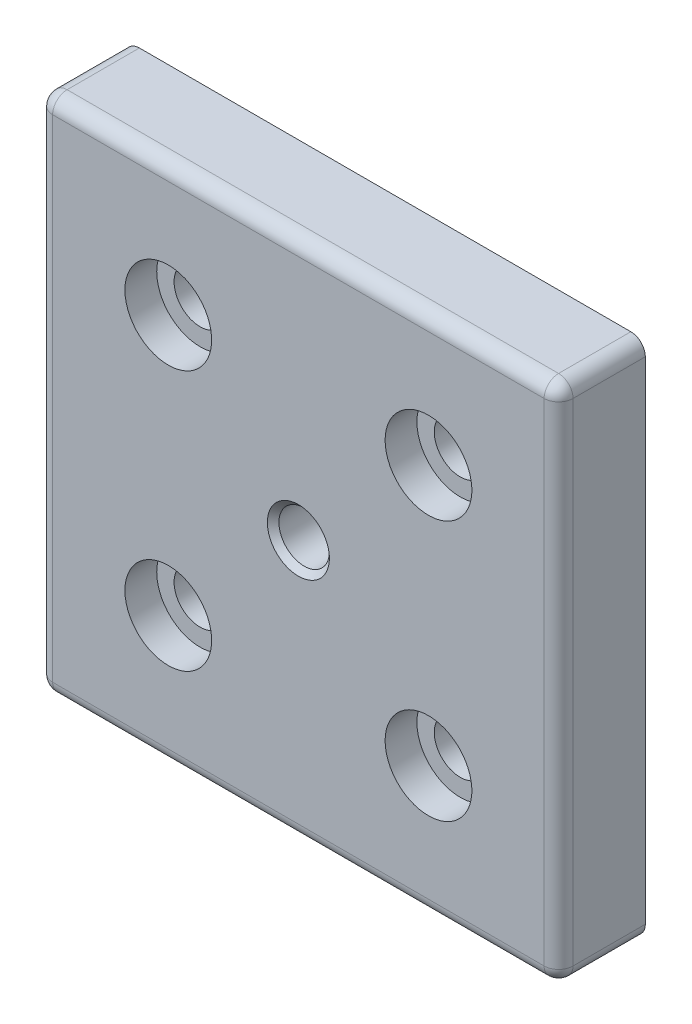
ISO-10303-21;
HEADER;
FILE_DESCRIPTION(('STEP AP214'),'2;1');
FILE_NAME('part.step','',(''),(''),'','','');
FILE_SCHEMA(('AUTOMOTIVE_DESIGN { 1 0 10303 214 1 1 1 1 }'));
ENDSEC;
DATA;
#1=APPLICATION_CONTEXT('core data for automotive mechanical design processes');
#2=APPLICATION_PROTOCOL_DEFINITION('international standard','automotive_design',2000,#1);
#3=PRODUCT_CONTEXT('',#1,'mechanical');
#4=PRODUCT('Part','Part','',(#3));
#5=PRODUCT_RELATED_PRODUCT_CATEGORY('part','',(#4));
#6=PRODUCT_DEFINITION_FORMATION('','',#4);
#7=PRODUCT_DEFINITION_CONTEXT('part definition',#1,'design');
#8=PRODUCT_DEFINITION('design','',#6,#7);
#9=PRODUCT_DEFINITION_SHAPE('','',#8);
#10=(LENGTH_UNIT() NAMED_UNIT(*) SI_UNIT(.MILLI.,.METRE.));
#11=(NAMED_UNIT(*) PLANE_ANGLE_UNIT() SI_UNIT($,.RADIAN.));
#12=(NAMED_UNIT(*) SI_UNIT($,.STERADIAN.) SOLID_ANGLE_UNIT());
#13=UNCERTAINTY_MEASURE_WITH_UNIT(LENGTH_MEASURE(1.E-05),#10,'distance_accuracy_value','');
#14=(GEOMETRIC_REPRESENTATION_CONTEXT(3) GLOBAL_UNCERTAINTY_ASSIGNED_CONTEXT((#13)) GLOBAL_UNIT_ASSIGNED_CONTEXT((#10,
#11,#12)) REPRESENTATION_CONTEXT('',''));
#15=CARTESIAN_POINT('',(0.,0.,0.));
#16=DIRECTION('',(0.,0.,1.));
#17=DIRECTION('',(1.,0.,0.));
#18=AXIS2_PLACEMENT_3D('',#15,#16,#17);
#19=CARTESIAN_POINT('',(0.,0.,15.));
#20=DIRECTION('',(0.,0.,1.));
#21=DIRECTION('',(1.,0.,0.));
#22=AXIS2_PLACEMENT_3D('',#19,#20,#21);
#23=PLANE('',#22);
#24=CARTESIAN_POINT('',(0.,0.,15.0000000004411));
#25=DIRECTION('',(0.,0.,1.));
#26=DIRECTION('',(1.,0.,0.));
#27=AXIS2_PLACEMENT_3D('',#24,#25,#26);
#28=CIRCLE('',#27,5.36562499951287);
#29=CARTESIAN_POINT('',(5.36562499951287,0.,15.0000000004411));
#30=VERTEX_POINT('',#29);
#31=EDGE_CURVE('E119',#30,#30,#28,.F.);
#32=ORIENTED_EDGE('',*,*,#31,.T.);
#33=EDGE_LOOP('',(#32));
#34=FACE_BOUND('',#33,.T.);
#35=CARTESIAN_POINT('',(22.5,-22.5,15.));
#36=DIRECTION('',(0.,0.,-1.));
#37=DIRECTION('',(-1.,0.,0.));
#38=AXIS2_PLACEMENT_3D('',#35,#36,#37);
#39=CIRCLE('',#38,7.5);
#40=CARTESIAN_POINT('',(15.,-22.5,15.));
#41=VERTEX_POINT('',#40);
#42=EDGE_CURVE('E123',#41,#41,#39,.T.);
#43=ORIENTED_EDGE('',*,*,#42,.T.);
#44=EDGE_LOOP('',(#43));
#45=FACE_BOUND('',#44,.T.);
#46=CARTESIAN_POINT('',(-22.5,-22.5,15.));
#47=DIRECTION('',(0.,0.,-1.));
#48=DIRECTION('',(-1.,0.,0.));
#49=AXIS2_PLACEMENT_3D('',#46,#47,#48);
#50=CIRCLE('',#49,7.5);
#51=CARTESIAN_POINT('',(-30.,-22.5,15.));
#52=VERTEX_POINT('',#51);
#53=EDGE_CURVE('E127',#52,#52,#50,.T.);
#54=ORIENTED_EDGE('',*,*,#53,.T.);
#55=EDGE_LOOP('',(#54));
#56=FACE_BOUND('',#55,.T.);
#57=CARTESIAN_POINT('',(-22.5,22.5,15.));
#58=DIRECTION('',(0.,0.,-1.));
#59=DIRECTION('',(-1.,0.,0.));
#60=AXIS2_PLACEMENT_3D('',#57,#58,#59);
#61=CIRCLE('',#60,7.5);
#62=CARTESIAN_POINT('',(-30.,22.5,15.));
#63=VERTEX_POINT('',#62);
#64=EDGE_CURVE('E19',#63,#63,#61,.T.);
#65=ORIENTED_EDGE('',*,*,#64,.T.);
#66=EDGE_LOOP('',(#65));
#67=FACE_BOUND('',#66,.T.);
#68=CARTESIAN_POINT('',(22.5,22.5,15.));
#69=DIRECTION('',(0.,0.,-1.));
#70=DIRECTION('',(-1.,0.,0.));
#71=AXIS2_PLACEMENT_3D('',#68,#69,#70);
#72=CIRCLE('',#71,7.5);
#73=CARTESIAN_POINT('',(15.,22.5,15.));
#74=VERTEX_POINT('',#73);
#75=EDGE_CURVE('E129',#74,#74,#72,.T.);
#76=ORIENTED_EDGE('',*,*,#75,.T.);
#77=EDGE_LOOP('',(#76));
#78=FACE_BOUND('',#77,.T.);
#79=DIRECTION('',(-1.,0.,0.));
#80=VECTOR('',#79,1.);
#81=CARTESIAN_POINT('',(22.5,-42.5,15.));
#82=LINE('',#81,#80);
#83=CARTESIAN_POINT('',(42.5,-42.5,15.));
#84=VERTEX_POINT('',#83);
#85=CARTESIAN_POINT('',(-42.5,-42.5,15.));
#86=VERTEX_POINT('',#85);
#87=EDGE_CURVE('E362',#84,#86,#82,.T.);
#88=ORIENTED_EDGE('',*,*,#87,.F.);
#89=DIRECTION('',(0.,-1.,0.));
#90=VECTOR('',#89,1.);
#91=CARTESIAN_POINT('',(42.5,22.5,15.));
#92=LINE('',#91,#90);
#93=CARTESIAN_POINT('',(42.5,42.5,15.));
#94=VERTEX_POINT('',#93);
#95=EDGE_CURVE('E229',#94,#84,#92,.T.);
#96=ORIENTED_EDGE('',*,*,#95,.F.);
#97=DIRECTION('',(1.,0.,0.));
#98=VECTOR('',#97,1.);
#99=CARTESIAN_POINT('',(-22.5,42.5,15.));
#100=LINE('',#99,#98);
#101=CARTESIAN_POINT('',(-42.5,42.5,15.));
#102=VERTEX_POINT('',#101);
#103=EDGE_CURVE('E126',#102,#94,#100,.T.);
#104=ORIENTED_EDGE('',*,*,#103,.F.);
#105=DIRECTION('',(0.,1.,0.));
#106=VECTOR('',#105,1.);
#107=CARTESIAN_POINT('',(-42.5,-22.5,15.));
#108=LINE('',#107,#106);
#109=EDGE_CURVE('E272',#86,#102,#108,.T.);
#110=ORIENTED_EDGE('',*,*,#109,.F.);
#111=EDGE_LOOP('',(#88,#96,#104,#110));
#112=FACE_BOUND('',#111,.T.);
#113=ADVANCED_FACE('F15',(#34,#45,#56,#67,#78,#112),#23,.T.);
#114=CARTESIAN_POINT('',(-22.5,22.5,15.));
#115=DIRECTION('',(0.,0.,-1.));
#116=DIRECTION('',(-1.,0.,0.));
#117=AXIS2_PLACEMENT_3D('',#114,#115,#116);
#118=CYLINDRICAL_SURFACE('',#117,7.5);
#119=CARTESIAN_POINT('',(-22.5,22.5,9.5));
#120=DIRECTION('',(0.,0.,-1.));
#121=DIRECTION('',(-1.,0.,0.));
#122=AXIS2_PLACEMENT_3D('',#119,#120,#121);
#123=CIRCLE('',#122,7.5);
#124=CARTESIAN_POINT('',(-30.,22.5,9.5));
#125=VERTEX_POINT('',#124);
#126=EDGE_CURVE('E116',#125,#125,#123,.T.);
#127=ORIENTED_EDGE('',*,*,#126,.T.);
#128=EDGE_LOOP('',(#127));
#129=FACE_BOUND('',#128,.T.);
#130=ORIENTED_EDGE('',*,*,#64,.F.);
#131=EDGE_LOOP('',(#130));
#132=FACE_BOUND('',#131,.T.);
#133=ADVANCED_FACE('F137',(#129,#132),#118,.F.);
#134=CARTESIAN_POINT('',(22.5,22.5,15.));
#135=DIRECTION('',(0.,0.,-1.));
#136=DIRECTION('',(-1.,0.,0.));
#137=AXIS2_PLACEMENT_3D('',#134,#135,#136);
#138=CYLINDRICAL_SURFACE('',#137,7.5);
#139=CARTESIAN_POINT('',(22.5,22.5,9.5));
#140=DIRECTION('',(0.,0.,-1.));
#141=DIRECTION('',(-1.,0.,0.));
#142=AXIS2_PLACEMENT_3D('',#139,#140,#141);
#143=CIRCLE('',#142,7.5);
#144=CARTESIAN_POINT('',(15.,22.5,9.5));
#145=VERTEX_POINT('',#144);
#146=EDGE_CURVE('E113',#145,#145,#143,.T.);
#147=ORIENTED_EDGE('',*,*,#146,.T.);
#148=EDGE_LOOP('',(#147));
#149=FACE_BOUND('',#148,.T.);
#150=ORIENTED_EDGE('',*,*,#75,.F.);
#151=EDGE_LOOP('',(#150));
#152=FACE_BOUND('',#151,.T.);
#153=ADVANCED_FACE('F139',(#149,#152),#138,.F.);
#154=CARTESIAN_POINT('',(-22.5,-22.5,15.));
#155=DIRECTION('',(0.,0.,-1.));
#156=DIRECTION('',(-1.,0.,0.));
#157=AXIS2_PLACEMENT_3D('',#154,#155,#156);
#158=CYLINDRICAL_SURFACE('',#157,7.5);
#159=CARTESIAN_POINT('',(-22.5,-22.5,9.5));
#160=DIRECTION('',(0.,0.,-1.));
#161=DIRECTION('',(-1.,0.,0.));
#162=AXIS2_PLACEMENT_3D('',#159,#160,#161);
#163=CIRCLE('',#162,7.5);
#164=CARTESIAN_POINT('',(-30.,-22.5,9.5));
#165=VERTEX_POINT('',#164);
#166=EDGE_CURVE('E110',#165,#165,#163,.T.);
#167=ORIENTED_EDGE('',*,*,#166,.T.);
#168=EDGE_LOOP('',(#167));
#169=FACE_BOUND('',#168,.T.);
#170=ORIENTED_EDGE('',*,*,#53,.F.);
#171=EDGE_LOOP('',(#170));
#172=FACE_BOUND('',#171,.T.);
#173=ADVANCED_FACE('F147',(#169,#172),#158,.F.);
#174=CARTESIAN_POINT('',(22.5,-22.5,15.));
#175=DIRECTION('',(0.,0.,-1.));
#176=DIRECTION('',(-1.,0.,0.));
#177=AXIS2_PLACEMENT_3D('',#174,#175,#176);
#178=CYLINDRICAL_SURFACE('',#177,7.5);
#179=CARTESIAN_POINT('',(22.5,-22.5,9.5));
#180=DIRECTION('',(0.,0.,-1.));
#181=DIRECTION('',(-1.,0.,0.));
#182=AXIS2_PLACEMENT_3D('',#179,#180,#181);
#183=CIRCLE('',#182,7.5);
#184=CARTESIAN_POINT('',(15.,-22.5,9.5));
#185=VERTEX_POINT('',#184);
#186=EDGE_CURVE('E106',#185,#185,#183,.T.);
#187=ORIENTED_EDGE('',*,*,#186,.T.);
#188=EDGE_LOOP('',(#187));
#189=FACE_BOUND('',#188,.T.);
#190=ORIENTED_EDGE('',*,*,#42,.F.);
#191=EDGE_LOOP('',(#190));
#192=FACE_BOUND('',#191,.T.);
#193=ADVANCED_FACE('F287',(#189,#192),#178,.F.);
#194=CARTESIAN_POINT('',(-22.5,42.5,12.5));
#195=DIRECTION('',(1.,0.,0.));
#196=DIRECTION('',(0.,1.,0.));
#197=AXIS2_PLACEMENT_3D('',#194,#195,#196);
#198=CYLINDRICAL_SURFACE('',#197,2.5);
#199=CARTESIAN_POINT('',(-42.5,42.5,12.5));
#200=DIRECTION('',(1.,0.,0.));
#201=DIRECTION('',(0.,1.,0.));
#202=AXIS2_PLACEMENT_3D('',#199,#200,#201);
#203=CIRCLE('',#202,2.5);
#204=CARTESIAN_POINT('',(-42.5,45.,12.5));
#205=VERTEX_POINT('',#204);
#206=EDGE_CURVE('E276',#102,#205,#203,.F.);
#207=ORIENTED_EDGE('',*,*,#206,.F.);
#208=ORIENTED_EDGE('',*,*,#103,.T.);
#209=CARTESIAN_POINT('',(42.5,42.5,12.5));
#210=DIRECTION('',(1.,0.,0.));
#211=DIRECTION('',(0.,1.,0.));
#212=AXIS2_PLACEMENT_3D('',#209,#210,#211);
#213=CIRCLE('',#212,2.5);
#214=CARTESIAN_POINT('',(42.5,45.,12.5));
#215=VERTEX_POINT('',#214);
#216=EDGE_CURVE('E226',#215,#94,#213,.T.);
#217=ORIENTED_EDGE('',*,*,#216,.F.);
#218=DIRECTION('',(1.,0.,0.));
#219=VECTOR('',#218,1.);
#220=CARTESIAN_POINT('',(-45.,45.,12.5));
#221=LINE('',#220,#219);
#222=EDGE_CURVE('E109',#205,#215,#221,.T.);
#223=ORIENTED_EDGE('',*,*,#222,.F.);
#224=EDGE_LOOP('',(#207,#208,#217,#223));
#225=FACE_BOUND('',#224,.T.);
#226=ADVANCED_FACE('F284',(#225),#198,.T.);
#227=CARTESIAN_POINT('',(-42.5,42.5,12.5));
#228=DIRECTION('',(1.,0.,0.));
#229=DIRECTION('',(0.,1.,0.));
#230=AXIS2_PLACEMENT_3D('',#227,#228,#229);
#231=SPHERICAL_SURFACE('',#230,2.5);
#232=ORIENTED_EDGE('',*,*,#206,.T.);
#233=CARTESIAN_POINT('',(-42.5,42.5,12.5));
#234=DIRECTION('',(0.,0.,1.));
#235=DIRECTION('',(1.,0.,0.));
#236=AXIS2_PLACEMENT_3D('',#233,#234,#235);
#237=CIRCLE('',#236,2.5);
#238=CARTESIAN_POINT('',(-45.,42.5,12.5));
#239=VERTEX_POINT('',#238);
#240=EDGE_CURVE('E232',#239,#205,#237,.F.);
#241=ORIENTED_EDGE('',*,*,#240,.F.);
#242=CARTESIAN_POINT('',(-42.5,42.5,12.5));
#243=DIRECTION('',(0.,1.,0.));
#244=DIRECTION('',(-1.,0.,0.));
#245=AXIS2_PLACEMENT_3D('',#242,#243,#244);
#246=CIRCLE('',#245,2.5);
#247=EDGE_CURVE('E273',#102,#239,#246,.F.);
#248=ORIENTED_EDGE('',*,*,#247,.F.);
#249=EDGE_LOOP('',(#232,#241,#248));
#250=FACE_BOUND('',#249,.T.);
#251=ADVANCED_FACE('F281',(#250),#231,.T.);
#252=CARTESIAN_POINT('',(-42.5,-22.5,12.5));
#253=DIRECTION('',(0.,1.,0.));
#254=DIRECTION('',(-1.,0.,0.));
#255=AXIS2_PLACEMENT_3D('',#252,#253,#254);
#256=CYLINDRICAL_SURFACE('',#255,2.5);
#257=CARTESIAN_POINT('',(-42.5,-42.5,12.5));
#258=DIRECTION('',(0.,-1.,0.));
#259=DIRECTION('',(1.,0.,0.));
#260=AXIS2_PLACEMENT_3D('',#257,#258,#259);
#261=CIRCLE('',#260,2.5);
#262=CARTESIAN_POINT('',(-45.,-42.5,12.5));
#263=VERTEX_POINT('',#262);
#264=EDGE_CURVE('E268',#86,#263,#261,.T.);
#265=ORIENTED_EDGE('',*,*,#264,.F.);
#266=ORIENTED_EDGE('',*,*,#109,.T.);
#267=ORIENTED_EDGE('',*,*,#247,.T.);
#268=DIRECTION('',(0.,1.,0.));
#269=VECTOR('',#268,1.);
#270=CARTESIAN_POINT('',(-45.,-45.,12.5));
#271=LINE('',#270,#269);
#272=EDGE_CURVE('E74',#263,#239,#271,.T.);
#273=ORIENTED_EDGE('',*,*,#272,.F.);
#274=EDGE_LOOP('',(#265,#266,#267,#273));
#275=FACE_BOUND('',#274,.T.);
#276=ADVANCED_FACE('F261',(#275),#256,.T.);
#277=CARTESIAN_POINT('',(-42.5,-42.5,12.5));
#278=DIRECTION('',(1.,0.,0.));
#279=DIRECTION('',(0.,1.,0.));
#280=AXIS2_PLACEMENT_3D('',#277,#278,#279);
#281=SPHERICAL_SURFACE('',#280,2.5);
#282=ORIENTED_EDGE('',*,*,#264,.T.);
#283=CARTESIAN_POINT('',(-42.5,-42.5,12.5));
#284=DIRECTION('',(0.,0.,1.));
#285=DIRECTION('',(1.,0.,0.));
#286=AXIS2_PLACEMENT_3D('',#283,#284,#285);
#287=CIRCLE('',#286,2.5);
#288=CARTESIAN_POINT('',(-42.5,-45.,12.5));
#289=VERTEX_POINT('',#288);
#290=EDGE_CURVE('E357',#289,#263,#287,.F.);
#291=ORIENTED_EDGE('',*,*,#290,.F.);
#292=CARTESIAN_POINT('',(-42.5,-42.5,12.5));
#293=DIRECTION('',(-1.,0.,0.));
#294=DIRECTION('',(0.,-1.,0.));
#295=AXIS2_PLACEMENT_3D('',#292,#293,#294);
#296=CIRCLE('',#295,2.5);
#297=EDGE_CURVE('E271',#86,#289,#296,.F.);
#298=ORIENTED_EDGE('',*,*,#297,.F.);
#299=EDGE_LOOP('',(#282,#291,#298));
#300=FACE_BOUND('',#299,.T.);
#301=ADVANCED_FACE('F256',(#300),#281,.T.);
#302=CARTESIAN_POINT('',(22.5,-42.5,12.5));
#303=DIRECTION('',(-1.,0.,0.));
#304=DIRECTION('',(0.,-1.,0.));
#305=AXIS2_PLACEMENT_3D('',#302,#303,#304);
#306=CYLINDRICAL_SURFACE('',#305,2.5);
#307=CARTESIAN_POINT('',(42.5,-42.5,12.5));
#308=DIRECTION('',(1.,0.,0.));
#309=DIRECTION('',(0.,1.,0.));
#310=AXIS2_PLACEMENT_3D('',#307,#308,#309);
#311=CIRCLE('',#310,2.5);
#312=CARTESIAN_POINT('',(42.5,-45.,12.5));
#313=VERTEX_POINT('',#312);
#314=EDGE_CURVE('E241',#84,#313,#311,.T.);
#315=ORIENTED_EDGE('',*,*,#314,.F.);
#316=ORIENTED_EDGE('',*,*,#87,.T.);
#317=ORIENTED_EDGE('',*,*,#297,.T.);
#318=DIRECTION('',(1.,0.,0.));
#319=VECTOR('',#318,1.);
#320=CARTESIAN_POINT('',(45.,-45.,12.5));
#321=LINE('',#320,#319);
#322=EDGE_CURVE('E242',#313,#289,#321,.F.);
#323=ORIENTED_EDGE('',*,*,#322,.F.);
#324=EDGE_LOOP('',(#315,#316,#317,#323));
#325=FACE_BOUND('',#324,.T.);
#326=ADVANCED_FACE('F252',(#325),#306,.T.);
#327=CARTESIAN_POINT('',(42.5,-42.5,12.5));
#328=DIRECTION('',(1.,0.,0.));
#329=DIRECTION('',(0.,1.,0.));
#330=AXIS2_PLACEMENT_3D('',#327,#328,#329);
#331=SPHERICAL_SURFACE('',#330,2.5);
#332=CARTESIAN_POINT('',(42.5,-42.5,12.5));
#333=DIRECTION('',(0.,-1.,0.));
#334=DIRECTION('',(0.,0.,-1.));
#335=AXIS2_PLACEMENT_3D('',#332,#333,#334);
#336=CIRCLE('',#335,2.5);
#337=CARTESIAN_POINT('',(45.,-42.5,12.5));
#338=VERTEX_POINT('',#337);
#339=EDGE_CURVE('E238',#84,#338,#336,.F.);
#340=ORIENTED_EDGE('',*,*,#339,.F.);
#341=ORIENTED_EDGE('',*,*,#314,.T.);
#342=CARTESIAN_POINT('',(42.5,-42.5,12.5));
#343=DIRECTION('',(0.,0.,1.));
#344=DIRECTION('',(1.,0.,0.));
#345=AXIS2_PLACEMENT_3D('',#342,#343,#344);
#346=CIRCLE('',#345,2.5);
#347=EDGE_CURVE('E233',#338,#313,#346,.F.);
#348=ORIENTED_EDGE('',*,*,#347,.F.);
#349=EDGE_LOOP('',(#340,#341,#348));
#350=FACE_BOUND('',#349,.T.);
#351=ADVANCED_FACE('F249',(#350),#331,.T.);
#352=CARTESIAN_POINT('',(42.5,22.5,12.5));
#353=DIRECTION('',(0.,-1.,0.));
#354=DIRECTION('',(0.,0.,-1.));
#355=AXIS2_PLACEMENT_3D('',#352,#353,#354);
#356=CYLINDRICAL_SURFACE('',#355,2.5);
#357=CARTESIAN_POINT('',(42.5,42.5,12.5));
#358=DIRECTION('',(0.,-1.,0.));
#359=DIRECTION('',(1.,0.,0.));
#360=AXIS2_PLACEMENT_3D('',#357,#358,#359);
#361=CIRCLE('',#360,2.5);
#362=CARTESIAN_POINT('',(45.,42.5,12.5));
#363=VERTEX_POINT('',#362);
#364=EDGE_CURVE('E122',#94,#363,#361,.F.);
#365=ORIENTED_EDGE('',*,*,#364,.F.);
#366=ORIENTED_EDGE('',*,*,#95,.T.);
#367=ORIENTED_EDGE('',*,*,#339,.T.);
#368=DIRECTION('',(0.,1.,0.));
#369=VECTOR('',#368,1.);
#370=CARTESIAN_POINT('',(45.,45.,12.5));
#371=LINE('',#370,#369);
#372=EDGE_CURVE('E341',#363,#338,#371,.F.);
#373=ORIENTED_EDGE('',*,*,#372,.F.);
#374=EDGE_LOOP('',(#365,#366,#367,#373));
#375=FACE_BOUND('',#374,.T.);
#376=ADVANCED_FACE('F216',(#375),#356,.T.);
#377=CARTESIAN_POINT('',(42.5,42.5,12.5));
#378=DIRECTION('',(1.,0.,0.));
#379=DIRECTION('',(0.,1.,0.));
#380=AXIS2_PLACEMENT_3D('',#377,#378,#379);
#381=SPHERICAL_SURFACE('',#380,2.5);
#382=ORIENTED_EDGE('',*,*,#216,.T.);
#383=ORIENTED_EDGE('',*,*,#364,.T.);
#384=CARTESIAN_POINT('',(42.5,42.5,12.5));
#385=DIRECTION('',(0.,0.,1.));
#386=DIRECTION('',(1.,0.,0.));
#387=AXIS2_PLACEMENT_3D('',#384,#385,#386);
#388=CIRCLE('',#387,2.5);
#389=EDGE_CURVE('E222',#215,#363,#388,.F.);
#390=ORIENTED_EDGE('',*,*,#389,.F.);
#391=EDGE_LOOP('',(#382,#383,#390));
#392=FACE_BOUND('',#391,.T.);
#393=ADVANCED_FACE('F211',(#392),#381,.T.);
#394=CARTESIAN_POINT('',(0.,0.,15.0000000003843));
#395=DIRECTION('',(0.,0.,1.));
#396=DIRECTION('',(1.,0.,0.));
#397=AXIS2_PLACEMENT_3D('',#394,#395,#396);
#398=CONICAL_SURFACE('',#397,5.36562499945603,0.785398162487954);
#399=ORIENTED_EDGE('',*,*,#31,.F.);
#400=EDGE_LOOP('',(#399));
#401=FACE_BOUND('',#400,.T.);
#402=CARTESIAN_POINT('',(0.,0.,14.));
#403=DIRECTION('',(0.,0.,1.));
#404=DIRECTION('',(1.,0.,0.));
#405=AXIS2_PLACEMENT_3D('',#402,#403,#404);
#406=CIRCLE('',#405,4.365625);
#407=CARTESIAN_POINT('',(4.365625,0.,14.));
#408=VERTEX_POINT('',#407);
#409=EDGE_CURVE('E105',#408,#408,#406,.F.);
#410=ORIENTED_EDGE('',*,*,#409,.T.);
#411=EDGE_LOOP('',(#410));
#412=FACE_BOUND('',#411,.T.);
#413=ADVANCED_FACE('F207',(#401,#412),#398,.F.);
#414=CARTESIAN_POINT('',(-30.15,30.15,9.5));
#415=DIRECTION('',(0.,0.,-1.));
#416=DIRECTION('',(1.,0.,0.));
#417=AXIS2_PLACEMENT_3D('',#414,#415,#416);
#418=PLANE('',#417);
#419=CARTESIAN_POINT('',(-22.5,22.5,9.5));
#420=DIRECTION('',(0.,0.,1.));
#421=DIRECTION('',(1.,0.,0.));
#422=AXIS2_PLACEMENT_3D('',#419,#420,#421);
#423=CIRCLE('',#422,4.5);
#424=CARTESIAN_POINT('',(-18.,22.5,9.5));
#425=VERTEX_POINT('',#424);
#426=EDGE_CURVE('E102',#425,#425,#423,.F.);
#427=ORIENTED_EDGE('',*,*,#426,.T.);
#428=EDGE_LOOP('',(#427));
#429=FACE_BOUND('',#428,.T.);
#430=ORIENTED_EDGE('',*,*,#126,.F.);
#431=EDGE_LOOP('',(#430));
#432=FACE_BOUND('',#431,.T.);
#433=ADVANCED_FACE('F210',(#429,#432),#418,.F.);
#434=CARTESIAN_POINT('',(14.85,30.15,9.5));
#435=DIRECTION('',(0.,0.,-1.));
#436=DIRECTION('',(1.,0.,0.));
#437=AXIS2_PLACEMENT_3D('',#434,#435,#436);
#438=PLANE('',#437);
#439=CARTESIAN_POINT('',(22.5,22.5,9.5));
#440=DIRECTION('',(0.,0.,1.));
#441=DIRECTION('',(1.,0.,0.));
#442=AXIS2_PLACEMENT_3D('',#439,#440,#441);
#443=CIRCLE('',#442,4.5);
#444=CARTESIAN_POINT('',(27.,22.5,9.5));
#445=VERTEX_POINT('',#444);
#446=EDGE_CURVE('E99',#445,#445,#443,.F.);
#447=ORIENTED_EDGE('',*,*,#446,.T.);
#448=EDGE_LOOP('',(#447));
#449=FACE_BOUND('',#448,.T.);
#450=ORIENTED_EDGE('',*,*,#146,.F.);
#451=EDGE_LOOP('',(#450));
#452=FACE_BOUND('',#451,.T.);
#453=ADVANCED_FACE('F400',(#449,#452),#438,.F.);
#454=CARTESIAN_POINT('',(-30.15,-14.85,9.5));
#455=DIRECTION('',(0.,0.,-1.));
#456=DIRECTION('',(1.,0.,0.));
#457=AXIS2_PLACEMENT_3D('',#454,#455,#456);
#458=PLANE('',#457);
#459=CARTESIAN_POINT('',(-22.5,-22.5,9.5));
#460=DIRECTION('',(0.,0.,1.));
#461=DIRECTION('',(1.,0.,0.));
#462=AXIS2_PLACEMENT_3D('',#459,#460,#461);
#463=CIRCLE('',#462,4.5);
#464=CARTESIAN_POINT('',(-18.,-22.5,9.5));
#465=VERTEX_POINT('',#464);
#466=EDGE_CURVE('E96',#465,#465,#463,.F.);
#467=ORIENTED_EDGE('',*,*,#466,.T.);
#468=EDGE_LOOP('',(#467));
#469=FACE_BOUND('',#468,.T.);
#470=ORIENTED_EDGE('',*,*,#166,.F.);
#471=EDGE_LOOP('',(#470));
#472=FACE_BOUND('',#471,.T.);
#473=ADVANCED_FACE('F406',(#469,#472),#458,.F.);
#474=CARTESIAN_POINT('',(14.85,-14.85,9.5));
#475=DIRECTION('',(0.,0.,-1.));
#476=DIRECTION('',(1.,0.,0.));
#477=AXIS2_PLACEMENT_3D('',#474,#475,#476);
#478=PLANE('',#477);
#479=CARTESIAN_POINT('',(22.5,-22.5,9.5));
#480=DIRECTION('',(0.,0.,1.));
#481=DIRECTION('',(1.,0.,0.));
#482=AXIS2_PLACEMENT_3D('',#479,#480,#481);
#483=CIRCLE('',#482,4.5);
#484=CARTESIAN_POINT('',(27.,-22.5,9.5));
#485=VERTEX_POINT('',#484);
#486=EDGE_CURVE('E89',#485,#485,#483,.F.);
#487=ORIENTED_EDGE('',*,*,#486,.T.);
#488=EDGE_LOOP('',(#487));
#489=FACE_BOUND('',#488,.T.);
#490=ORIENTED_EDGE('',*,*,#186,.F.);
#491=EDGE_LOOP('',(#490));
#492=FACE_BOUND('',#491,.T.);
#493=ADVANCED_FACE('F17',(#489,#492),#478,.F.);
#494=CARTESIAN_POINT('',(-45.,45.,0.));
#495=DIRECTION('',(0.,1.,0.));
#496=DIRECTION('',(0.,0.,1.));
#497=AXIS2_PLACEMENT_3D('',#494,#495,#496);
#498=PLANE('',#497);
#499=DIRECTION('',(0.,0.,1.));
#500=VECTOR('',#499,1.);
#501=CARTESIAN_POINT('',(-42.5,45.,0.));
#502=LINE('',#501,#500);
#503=CARTESIAN_POINT('',(-42.5,45.,0.));
#504=VERTEX_POINT('',#503);
#505=EDGE_CURVE('E60',#205,#504,#502,.F.);
#506=ORIENTED_EDGE('',*,*,#505,.F.);
#507=ORIENTED_EDGE('',*,*,#222,.T.);
#508=DIRECTION('',(0.,0.,1.));
#509=VECTOR('',#508,1.);
#510=CARTESIAN_POINT('',(42.5,45.,0.));
#511=LINE('',#510,#509);
#512=CARTESIAN_POINT('',(42.5,45.,0.));
#513=VERTEX_POINT('',#512);
#514=EDGE_CURVE('E339',#513,#215,#511,.T.);
#515=ORIENTED_EDGE('',*,*,#514,.F.);
#516=DIRECTION('',(1.,0.,0.));
#517=VECTOR('',#516,1.);
#518=CARTESIAN_POINT('',(0.,45.,0.));
#519=LINE('',#518,#517);
#520=EDGE_CURVE('E87',#513,#504,#519,.F.);
#521=ORIENTED_EDGE('',*,*,#520,.T.);
#522=EDGE_LOOP('',(#506,#507,#515,#521));
#523=FACE_BOUND('',#522,.T.);
#524=ADVANCED_FACE('F203',(#523),#498,.T.);
#525=CARTESIAN_POINT('',(-42.5,42.5,0.));
#526=DIRECTION('',(0.,0.,1.));
#527=DIRECTION('',(1.,0.,0.));
#528=AXIS2_PLACEMENT_3D('',#525,#526,#527);
#529=CYLINDRICAL_SURFACE('',#528,2.5);
#530=ORIENTED_EDGE('',*,*,#240,.T.);
#531=ORIENTED_EDGE('',*,*,#505,.T.);
#532=CARTESIAN_POINT('',(-42.5,42.5,0.));
#533=DIRECTION('',(0.,0.,1.));
#534=DIRECTION('',(1.,0.,0.));
#535=AXIS2_PLACEMENT_3D('',#532,#533,#534);
#536=CIRCLE('',#535,2.5);
#537=CARTESIAN_POINT('',(-45.,42.5,0.));
#538=VERTEX_POINT('',#537);
#539=EDGE_CURVE('E80',#504,#538,#536,.T.);
#540=ORIENTED_EDGE('',*,*,#539,.T.);
#541=DIRECTION('',(0.,0.,1.));
#542=VECTOR('',#541,1.);
#543=CARTESIAN_POINT('',(-45.,42.5,0.));
#544=LINE('',#543,#542);
#545=EDGE_CURVE('E67',#239,#538,#544,.F.);
#546=ORIENTED_EDGE('',*,*,#545,.F.);
#547=EDGE_LOOP('',(#530,#531,#540,#546));
#548=FACE_BOUND('',#547,.T.);
#549=ADVANCED_FACE('F86',(#548),#529,.T.);
#550=CARTESIAN_POINT('',(-45.,-45.,0.));
#551=DIRECTION('',(-1.,0.,0.));
#552=DIRECTION('',(0.,0.,1.));
#553=AXIS2_PLACEMENT_3D('',#550,#551,#552);
#554=PLANE('',#553);
#555=DIRECTION('',(0.,0.,1.));
#556=VECTOR('',#555,1.);
#557=CARTESIAN_POINT('',(-45.,-42.5,0.));
#558=LINE('',#557,#556);
#559=CARTESIAN_POINT('',(-45.,-42.5,0.));
#560=VERTEX_POINT('',#559);
#561=EDGE_CURVE('E245',#263,#560,#558,.F.);
#562=ORIENTED_EDGE('',*,*,#561,.F.);
#563=ORIENTED_EDGE('',*,*,#272,.T.);
#564=ORIENTED_EDGE('',*,*,#545,.T.);
#565=DIRECTION('',(0.,1.,0.));
#566=VECTOR('',#565,1.);
#567=CARTESIAN_POINT('',(-45.,0.,0.));
#568=LINE('',#567,#566);
#569=EDGE_CURVE('E71',#538,#560,#568,.F.);
#570=ORIENTED_EDGE('',*,*,#569,.T.);
#571=EDGE_LOOP('',(#562,#563,#564,#570));
#572=FACE_BOUND('',#571,.T.);
#573=ADVANCED_FACE('F70',(#572),#554,.T.);
#574=CARTESIAN_POINT('',(-42.5,-42.5,0.));
#575=DIRECTION('',(0.,0.,1.));
#576=DIRECTION('',(1.,0.,0.));
#577=AXIS2_PLACEMENT_3D('',#574,#575,#576);
#578=CYLINDRICAL_SURFACE('',#577,2.5);
#579=ORIENTED_EDGE('',*,*,#290,.T.);
#580=ORIENTED_EDGE('',*,*,#561,.T.);
#581=CARTESIAN_POINT('',(-42.5,-42.5,0.));
#582=DIRECTION('',(0.,0.,1.));
#583=DIRECTION('',(1.,0.,0.));
#584=AXIS2_PLACEMENT_3D('',#581,#582,#583);
#585=CIRCLE('',#584,2.5);
#586=CARTESIAN_POINT('',(-42.5,-45.,0.));
#587=VERTEX_POINT('',#586);
#588=EDGE_CURVE('E84',#560,#587,#585,.T.);
#589=ORIENTED_EDGE('',*,*,#588,.T.);
#590=DIRECTION('',(0.,0.,-1.));
#591=VECTOR('',#590,1.);
#592=CARTESIAN_POINT('',(-42.5,-45.,0.));
#593=LINE('',#592,#591);
#594=EDGE_CURVE('E237',#289,#587,#593,.T.);
#595=ORIENTED_EDGE('',*,*,#594,.F.);
#596=EDGE_LOOP('',(#579,#580,#589,#595));
#597=FACE_BOUND('',#596,.T.);
#598=ADVANCED_FACE('F194',(#597),#578,.T.);
#599=CARTESIAN_POINT('',(45.,-45.,0.));
#600=DIRECTION('',(0.,-1.,0.));
#601=DIRECTION('',(0.,0.,-1.));
#602=AXIS2_PLACEMENT_3D('',#599,#600,#601);
#603=PLANE('',#602);
#604=ORIENTED_EDGE('',*,*,#594,.T.);
#605=DIRECTION('',(1.,0.,0.));
#606=VECTOR('',#605,1.);
#607=CARTESIAN_POINT('',(0.,-45.,0.));
#608=LINE('',#607,#606);
#609=CARTESIAN_POINT('',(42.5,-45.,0.));
#610=VERTEX_POINT('',#609);
#611=EDGE_CURVE('E383',#587,#610,#608,.T.);
#612=ORIENTED_EDGE('',*,*,#611,.T.);
#613=DIRECTION('',(0.,0.,1.));
#614=VECTOR('',#613,1.);
#615=CARTESIAN_POINT('',(42.5,-45.,0.));
#616=LINE('',#615,#614);
#617=EDGE_CURVE('E236',#313,#610,#616,.F.);
#618=ORIENTED_EDGE('',*,*,#617,.F.);
#619=ORIENTED_EDGE('',*,*,#322,.T.);
#620=EDGE_LOOP('',(#604,#612,#618,#619));
#621=FACE_BOUND('',#620,.T.);
#622=ADVANCED_FACE('F190',(#621),#603,.T.);
#623=CARTESIAN_POINT('',(42.5,-42.5,0.));
#624=DIRECTION('',(0.,0.,1.));
#625=DIRECTION('',(1.,0.,0.));
#626=AXIS2_PLACEMENT_3D('',#623,#624,#625);
#627=CYLINDRICAL_SURFACE('',#626,2.5);
#628=ORIENTED_EDGE('',*,*,#347,.T.);
#629=ORIENTED_EDGE('',*,*,#617,.T.);
#630=CARTESIAN_POINT('',(42.5,-42.5,0.));
#631=DIRECTION('',(0.,0.,1.));
#632=DIRECTION('',(1.,0.,0.));
#633=AXIS2_PLACEMENT_3D('',#630,#631,#632);
#634=CIRCLE('',#633,2.5);
#635=CARTESIAN_POINT('',(45.,-42.5,0.));
#636=VERTEX_POINT('',#635);
#637=EDGE_CURVE('E381',#610,#636,#634,.T.);
#638=ORIENTED_EDGE('',*,*,#637,.T.);
#639=DIRECTION('',(0.,0.,-1.));
#640=VECTOR('',#639,1.);
#641=CARTESIAN_POINT('',(45.,-42.5,0.));
#642=LINE('',#641,#640);
#643=EDGE_CURVE('E344',#338,#636,#642,.T.);
#644=ORIENTED_EDGE('',*,*,#643,.F.);
#645=EDGE_LOOP('',(#628,#629,#638,#644));
#646=FACE_BOUND('',#645,.T.);
#647=ADVANCED_FACE('F186',(#646),#627,.T.);
#648=CARTESIAN_POINT('',(45.,45.,0.));
#649=DIRECTION('',(1.,0.,0.));
#650=DIRECTION('',(0.,0.,-1.));
#651=AXIS2_PLACEMENT_3D('',#648,#649,#650);
#652=PLANE('',#651);
#653=ORIENTED_EDGE('',*,*,#643,.T.);
#654=DIRECTION('',(0.,1.,0.));
#655=VECTOR('',#654,1.);
#656=CARTESIAN_POINT('',(45.,0.,0.));
#657=LINE('',#656,#655);
#658=CARTESIAN_POINT('',(45.,42.5,0.));
#659=VERTEX_POINT('',#658);
#660=EDGE_CURVE('E346',#636,#659,#657,.T.);
#661=ORIENTED_EDGE('',*,*,#660,.T.);
#662=DIRECTION('',(0.,0.,1.));
#663=VECTOR('',#662,1.);
#664=CARTESIAN_POINT('',(45.,42.5,0.));
#665=LINE('',#664,#663);
#666=EDGE_CURVE('E34',#363,#659,#665,.F.);
#667=ORIENTED_EDGE('',*,*,#666,.F.);
#668=ORIENTED_EDGE('',*,*,#372,.T.);
#669=EDGE_LOOP('',(#653,#661,#667,#668));
#670=FACE_BOUND('',#669,.T.);
#671=ADVANCED_FACE('F183',(#670),#652,.T.);
#672=CARTESIAN_POINT('',(42.5,42.5,0.));
#673=DIRECTION('',(0.,0.,1.));
#674=DIRECTION('',(1.,0.,0.));
#675=AXIS2_PLACEMENT_3D('',#672,#673,#674);
#676=CYLINDRICAL_SURFACE('',#675,2.5);
#677=ORIENTED_EDGE('',*,*,#389,.T.);
#678=ORIENTED_EDGE('',*,*,#666,.T.);
#679=CARTESIAN_POINT('',(42.5,42.5,0.));
#680=DIRECTION('',(0.,0.,1.));
#681=DIRECTION('',(1.,0.,0.));
#682=AXIS2_PLACEMENT_3D('',#679,#680,#681);
#683=CIRCLE('',#682,2.5);
#684=EDGE_CURVE('E380',#659,#513,#683,.T.);
#685=ORIENTED_EDGE('',*,*,#684,.T.);
#686=ORIENTED_EDGE('',*,*,#514,.T.);
#687=EDGE_LOOP('',(#677,#678,#685,#686));
#688=FACE_BOUND('',#687,.T.);
#689=ADVANCED_FACE('F179',(#688),#676,.T.);
#690=CARTESIAN_POINT('',(0.,0.,0.));
#691=DIRECTION('',(0.,0.,1.));
#692=DIRECTION('',(1.,0.,0.));
#693=AXIS2_PLACEMENT_3D('',#690,#691,#692);
#694=CYLINDRICAL_SURFACE('',#693,4.365625);
#695=ORIENTED_EDGE('',*,*,#409,.F.);
#696=EDGE_LOOP('',(#695));
#697=FACE_BOUND('',#696,.T.);
#698=CARTESIAN_POINT('',(0.,0.,0.));
#699=DIRECTION('',(0.,0.,1.));
#700=DIRECTION('',(1.,0.,0.));
#701=AXIS2_PLACEMENT_3D('',#698,#699,#700);
#702=CIRCLE('',#701,4.365625);
#703=CARTESIAN_POINT('',(4.365625,0.,0.));
#704=VERTEX_POINT('',#703);
#705=EDGE_CURVE('E377',#704,#704,#702,.F.);
#706=ORIENTED_EDGE('',*,*,#705,.T.);
#707=EDGE_LOOP('',(#706));
#708=FACE_BOUND('',#707,.T.);
#709=ADVANCED_FACE('F175',(#697,#708),#694,.F.);
#710=CARTESIAN_POINT('',(-22.5,22.5,0.));
#711=DIRECTION('',(0.,0.,1.));
#712=DIRECTION('',(1.,0.,0.));
#713=AXIS2_PLACEMENT_3D('',#710,#711,#712);
#714=CYLINDRICAL_SURFACE('',#713,4.5);
#715=CARTESIAN_POINT('',(-22.5,22.5,0.));
#716=DIRECTION('',(0.,0.,1.));
#717=DIRECTION('',(1.,0.,0.));
#718=AXIS2_PLACEMENT_3D('',#715,#716,#717);
#719=CIRCLE('',#718,4.5);
#720=CARTESIAN_POINT('',(-18.,22.5,0.));
#721=VERTEX_POINT('',#720);
#722=EDGE_CURVE('E374',#721,#721,#719,.F.);
#723=ORIENTED_EDGE('',*,*,#722,.T.);
#724=EDGE_LOOP('',(#723));
#725=FACE_BOUND('',#724,.T.);
#726=ORIENTED_EDGE('',*,*,#426,.F.);
#727=EDGE_LOOP('',(#726));
#728=FACE_BOUND('',#727,.T.);
#729=ADVANCED_FACE('F171',(#725,#728),#714,.F.);
#730=CARTESIAN_POINT('',(22.5,22.5,0.));
#731=DIRECTION('',(0.,0.,1.));
#732=DIRECTION('',(1.,0.,0.));
#733=AXIS2_PLACEMENT_3D('',#730,#731,#732);
#734=CYLINDRICAL_SURFACE('',#733,4.5);
#735=CARTESIAN_POINT('',(22.5,22.5,0.));
#736=DIRECTION('',(0.,0.,1.));
#737=DIRECTION('',(1.,0.,0.));
#738=AXIS2_PLACEMENT_3D('',#735,#736,#737);
#739=CIRCLE('',#738,4.5);
#740=CARTESIAN_POINT('',(27.,22.5,0.));
#741=VERTEX_POINT('',#740);
#742=EDGE_CURVE('E371',#741,#741,#739,.F.);
#743=ORIENTED_EDGE('',*,*,#742,.T.);
#744=EDGE_LOOP('',(#743));
#745=FACE_BOUND('',#744,.T.);
#746=ORIENTED_EDGE('',*,*,#446,.F.);
#747=EDGE_LOOP('',(#746));
#748=FACE_BOUND('',#747,.T.);
#749=ADVANCED_FACE('F167',(#745,#748),#734,.F.);
#750=CARTESIAN_POINT('',(-22.5,-22.5,0.));
#751=DIRECTION('',(0.,0.,1.));
#752=DIRECTION('',(1.,0.,0.));
#753=AXIS2_PLACEMENT_3D('',#750,#751,#752);
#754=CYLINDRICAL_SURFACE('',#753,4.5);
#755=CARTESIAN_POINT('',(-22.5,-22.5,0.));
#756=DIRECTION('',(0.,0.,1.));
#757=DIRECTION('',(1.,0.,0.));
#758=AXIS2_PLACEMENT_3D('',#755,#756,#757);
#759=CIRCLE('',#758,4.5);
#760=CARTESIAN_POINT('',(-18.,-22.5,0.));
#761=VERTEX_POINT('',#760);
#762=EDGE_CURVE('E25',#761,#761,#759,.F.);
#763=ORIENTED_EDGE('',*,*,#762,.T.);
#764=EDGE_LOOP('',(#763));
#765=FACE_BOUND('',#764,.T.);
#766=ORIENTED_EDGE('',*,*,#466,.F.);
#767=EDGE_LOOP('',(#766));
#768=FACE_BOUND('',#767,.T.);
#769=ADVANCED_FACE('F159',(#765,#768),#754,.F.);
#770=CARTESIAN_POINT('',(22.5,-22.5,0.));
#771=DIRECTION('',(0.,0.,1.));
#772=DIRECTION('',(1.,0.,0.));
#773=AXIS2_PLACEMENT_3D('',#770,#771,#772);
#774=CYLINDRICAL_SURFACE('',#773,4.5);
#775=CARTESIAN_POINT('',(22.5,-22.5,0.));
#776=DIRECTION('',(0.,0.,1.));
#777=DIRECTION('',(1.,0.,0.));
#778=AXIS2_PLACEMENT_3D('',#775,#776,#777);
#779=CIRCLE('',#778,4.5);
#780=CARTESIAN_POINT('',(27.,-22.5,0.));
#781=VERTEX_POINT('',#780);
#782=EDGE_CURVE('E10',#781,#781,#779,.F.);
#783=ORIENTED_EDGE('',*,*,#782,.T.);
#784=EDGE_LOOP('',(#783));
#785=FACE_BOUND('',#784,.T.);
#786=ORIENTED_EDGE('',*,*,#486,.F.);
#787=EDGE_LOOP('',(#786));
#788=FACE_BOUND('',#787,.T.);
#789=ADVANCED_FACE('F153',(#785,#788),#774,.F.);
#790=CARTESIAN_POINT('',(0.,0.,0.));
#791=DIRECTION('',(0.,0.,1.));
#792=DIRECTION('',(1.,0.,0.));
#793=AXIS2_PLACEMENT_3D('',#790,#791,#792);
#794=PLANE('',#793);
#795=ORIENTED_EDGE('',*,*,#782,.F.);
#796=EDGE_LOOP('',(#795));
#797=FACE_BOUND('',#796,.T.);
#798=ORIENTED_EDGE('',*,*,#762,.F.);
#799=EDGE_LOOP('',(#798));
#800=FACE_BOUND('',#799,.T.);
#801=ORIENTED_EDGE('',*,*,#742,.F.);
#802=EDGE_LOOP('',(#801));
#803=FACE_BOUND('',#802,.T.);
#804=ORIENTED_EDGE('',*,*,#722,.F.);
#805=EDGE_LOOP('',(#804));
#806=FACE_BOUND('',#805,.T.);
#807=ORIENTED_EDGE('',*,*,#705,.F.);
#808=EDGE_LOOP('',(#807));
#809=FACE_BOUND('',#808,.T.);
#810=ORIENTED_EDGE('',*,*,#660,.F.);
#811=ORIENTED_EDGE('',*,*,#637,.F.);
#812=ORIENTED_EDGE('',*,*,#611,.F.);
#813=ORIENTED_EDGE('',*,*,#588,.F.);
#814=ORIENTED_EDGE('',*,*,#569,.F.);
#815=ORIENTED_EDGE('',*,*,#539,.F.);
#816=ORIENTED_EDGE('',*,*,#520,.F.);
#817=ORIENTED_EDGE('',*,*,#684,.F.);
#818=EDGE_LOOP('',(#810,#811,#812,#813,#814,#815,#816,#817));
#819=FACE_BOUND('',#818,.T.);
#820=ADVANCED_FACE('F79',(#797,#800,#803,#806,#809,#819),#794,.F.);
#821=CLOSED_SHELL('',(#113,#133,#153,#173,#193,#226,#251,#276,#301,#326,#351,#376,#393,#413,
#433,#453,#473,#493,#524,#549,#573,#598,#622,#647,#671,#689,#709,#729,#749,#769,#789,#820));
#822=MANIFOLD_SOLID_BREP('B1',#821);
#823=ADVANCED_BREP_SHAPE_REPRESENTATION('',(#18,#822),#14);
#824=SHAPE_DEFINITION_REPRESENTATION(#9,#823);
ENDSEC;
END-ISO-10303-21;
